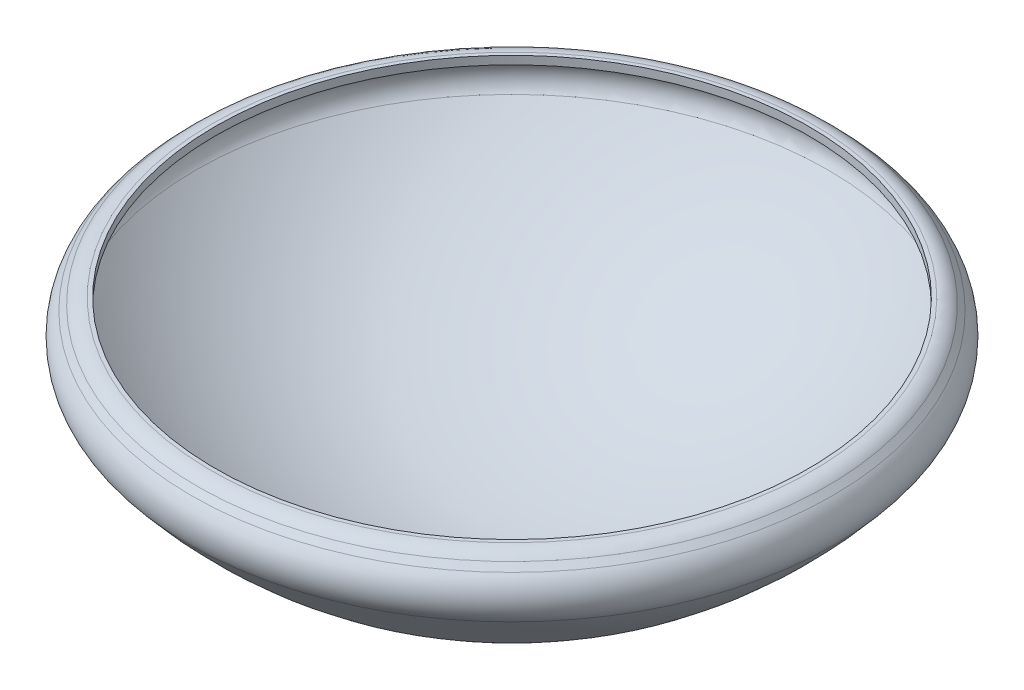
ISO-10303-21;
HEADER;
FILE_DESCRIPTION(('STEP AP214'),'2;1');
FILE_NAME('part.step','',(''),(''),'','','');
FILE_SCHEMA(('AUTOMOTIVE_DESIGN { 1 0 10303 214 1 1 1 1 }'));
ENDSEC;
DATA;
#1=APPLICATION_CONTEXT('core data for automotive mechanical design processes');
#2=APPLICATION_PROTOCOL_DEFINITION('international standard','automotive_design',2000,#1);
#3=PRODUCT_CONTEXT('',#1,'mechanical');
#4=PRODUCT('Part','Part','',(#3));
#5=PRODUCT_RELATED_PRODUCT_CATEGORY('part','',(#4));
#6=PRODUCT_DEFINITION_FORMATION('','',#4);
#7=PRODUCT_DEFINITION_CONTEXT('part definition',#1,'design');
#8=PRODUCT_DEFINITION('design','',#6,#7);
#9=PRODUCT_DEFINITION_SHAPE('','',#8);
#10=(LENGTH_UNIT() NAMED_UNIT(*) SI_UNIT(.MILLI.,.METRE.));
#11=(NAMED_UNIT(*) PLANE_ANGLE_UNIT() SI_UNIT($,.RADIAN.));
#12=(NAMED_UNIT(*) SI_UNIT($,.STERADIAN.) SOLID_ANGLE_UNIT());
#13=UNCERTAINTY_MEASURE_WITH_UNIT(LENGTH_MEASURE(1.E-05),#10,'distance_accuracy_value','');
#14=(GEOMETRIC_REPRESENTATION_CONTEXT(3) GLOBAL_UNCERTAINTY_ASSIGNED_CONTEXT((#13)) GLOBAL_UNIT_ASSIGNED_CONTEXT((#10,
#11,#12)) REPRESENTATION_CONTEXT('',''));
#15=CARTESIAN_POINT('',(0.,0.,0.));
#16=DIRECTION('',(0.,0.,1.));
#17=DIRECTION('',(1.,0.,0.));
#18=AXIS2_PLACEMENT_3D('',#15,#16,#17);
#19=CARTESIAN_POINT('',(7.29289321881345,0.,0.));
#20=DIRECTION('',(0.,-1.,0.));
#21=DIRECTION('',(1.,0.,0.));
#22=AXIS2_PLACEMENT_3D('',#19,#20,#21);
#23=PLANE('',#22);
#24=CARTESIAN_POINT('',(0.,0.,0.));
#25=DIRECTION('',(0.,1.,0.));
#26=DIRECTION('',(-1.,0.,0.));
#27=AXIS2_PLACEMENT_3D('',#24,#25,#26);
#28=CIRCLE('',#27,7.2);
#29=CARTESIAN_POINT('',(-7.2,0.,0.));
#30=VERTEX_POINT('',#29);
#31=EDGE_CURVE('E10',#30,#30,#28,.T.);
#32=ORIENTED_EDGE('',*,*,#31,.F.);
#33=EDGE_LOOP('',(#32));
#34=FACE_BOUND('',#33,.T.);
#35=CARTESIAN_POINT('',(0.,0.,0.));
#36=DIRECTION('',(0.,1.,0.));
#37=DIRECTION('',(-1.,0.,0.));
#38=AXIS2_PLACEMENT_3D('',#35,#36,#37);
#39=CIRCLE('',#38,7.29289321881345);
#40=CARTESIAN_POINT('',(-7.29289321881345,0.,0.));
#41=VERTEX_POINT('',#40);
#42=EDGE_CURVE('E64',#41,#41,#39,.T.);
#43=ORIENTED_EDGE('',*,*,#42,.T.);
#44=EDGE_LOOP('',(#43));
#45=FACE_BOUND('',#44,.T.);
#46=ADVANCED_FACE('F30',(#34,#45),#23,.F.);
#47=CARTESIAN_POINT('',(0.,3.10693936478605,0.));
#48=DIRECTION('',(0.,1.,0.));
#49=DIRECTION('',(-1.,0.,0.));
#50=AXIS2_PLACEMENT_3D('',#47,#48,#49);
#51=CYLINDRICAL_SURFACE('',#50,7.2);
#52=ORIENTED_EDGE('',*,*,#31,.T.);
#53=EDGE_LOOP('',(#52));
#54=FACE_BOUND('',#53,.T.);
#55=CARTESIAN_POINT('',(0.,-0.200000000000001,0.));
#56=DIRECTION('',(0.,1.,0.));
#57=DIRECTION('',(-1.,0.,0.));
#58=AXIS2_PLACEMENT_3D('',#55,#56,#57);
#59=CIRCLE('',#58,7.2);
#60=CARTESIAN_POINT('',(-7.2,-0.200000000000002,0.));
#61=VERTEX_POINT('',#60);
#62=EDGE_CURVE('E36',#61,#61,#59,.T.);
#63=ORIENTED_EDGE('',*,*,#62,.F.);
#64=EDGE_LOOP('',(#63));
#65=FACE_BOUND('',#64,.T.);
#66=ADVANCED_FACE('F98',(#54,#65),#51,.F.);
#67=CARTESIAN_POINT('',(7.29289321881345,-0.2,0.));
#68=DIRECTION('',(0.,-1.,0.));
#69=DIRECTION('',(1.,0.,0.));
#70=AXIS2_PLACEMENT_3D('',#67,#68,#69);
#71=PLANE('',#70);
#72=ORIENTED_EDGE('',*,*,#62,.T.);
#73=EDGE_LOOP('',(#72));
#74=FACE_BOUND('',#73,.T.);
#75=CARTESIAN_POINT('',(0.,-0.200000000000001,0.));
#76=DIRECTION('',(0.,1.,0.));
#77=DIRECTION('',(-1.,0.,0.));
#78=AXIS2_PLACEMENT_3D('',#75,#76,#77);
#79=CIRCLE('',#78,7.29289321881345);
#80=CARTESIAN_POINT('',(-7.29289321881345,-0.200000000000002,0.));
#81=VERTEX_POINT('',#80);
#82=EDGE_CURVE('E40',#81,#81,#79,.T.);
#83=ORIENTED_EDGE('',*,*,#82,.F.);
#84=EDGE_LOOP('',(#83));
#85=FACE_BOUND('',#84,.T.);
#86=ADVANCED_FACE('F103',(#74,#85),#71,.T.);
#87=CARTESIAN_POINT('',(0.,-0.500000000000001,0.));
#88=DIRECTION('',(0.,1.,0.));
#89=DIRECTION('',(-1.,0.,0.));
#90=AXIS2_PLACEMENT_3D('',#87,#88,#89);
#91=TOROIDAL_SURFACE('',#90,7.29289321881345,0.3);
#92=ORIENTED_EDGE('',*,*,#82,.T.);
#93=EDGE_LOOP('',(#92));
#94=FACE_BOUND('',#93,.T.);
#95=CARTESIAN_POINT('',(0.,-0.287867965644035,0.));
#96=DIRECTION('',(0.,1.,0.));
#97=DIRECTION('',(-1.,0.,0.));
#98=AXIS2_PLACEMENT_3D('',#95,#96,#97);
#99=CIRCLE('',#98,7.50502525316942);
#100=CARTESIAN_POINT('',(-7.50502525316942,-0.287867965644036,0.));
#101=VERTEX_POINT('',#100);
#102=EDGE_CURVE('E44',#101,#101,#99,.T.);
#103=ORIENTED_EDGE('',*,*,#102,.F.);
#104=EDGE_LOOP('',(#103));
#105=FACE_BOUND('',#104,.T.);
#106=ADVANCED_FACE('F107',(#94,#105),#91,.F.);
#107=CARTESIAN_POINT('',(0.,-0.421751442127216,0.));
#108=DIRECTION('',(0.,-1.,0.));
#109=DIRECTION('',(1.,0.,0.));
#110=AXIS2_PLACEMENT_3D('',#107,#108,#109);
#111=CONICAL_SURFACE('',#110,7.6389087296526,0.785398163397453);
#112=ORIENTED_EDGE('',*,*,#102,.T.);
#113=EDGE_LOOP('',(#112));
#114=FACE_BOUND('',#113,.T.);
#115=CARTESIAN_POINT('',(0.,-0.421751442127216,0.));
#116=DIRECTION('',(0.,1.,0.));
#117=DIRECTION('',(-1.,0.,0.));
#118=AXIS2_PLACEMENT_3D('',#115,#116,#117);
#119=CIRCLE('',#118,7.6389087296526);
#120=CARTESIAN_POINT('',(-7.6389087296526,-0.421751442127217,0.));
#121=VERTEX_POINT('',#120);
#122=EDGE_CURVE('E49',#121,#121,#119,.T.);
#123=ORIENTED_EDGE('',*,*,#122,.F.);
#124=EDGE_LOOP('',(#123));
#125=FACE_BOUND('',#124,.T.);
#126=ADVANCED_FACE('F113',(#114,#125),#111,.F.);
#127=CARTESIAN_POINT('',(0.,-0.810660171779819,0.));
#128=DIRECTION('',(0.,1.,0.));
#129=DIRECTION('',(-1.,0.,0.));
#130=AXIS2_PLACEMENT_3D('',#127,#128,#129);
#131=TOROIDAL_SURFACE('',#130,7.25,0.550000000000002);
#132=ORIENTED_EDGE('',*,*,#122,.T.);
#133=EDGE_LOOP('',(#132));
#134=FACE_BOUND('',#133,.T.);
#135=CARTESIAN_POINT('',(0.,-1.15858454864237,0.));
#136=DIRECTION('',(0.,1.,0.));
#137=DIRECTION('',(-1.,0.,0.));
#138=AXIS2_PLACEMENT_3D('',#135,#136,#137);
#139=CIRCLE('',#138,7.67596787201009);
#140=CARTESIAN_POINT('',(-7.67596787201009,-1.15858454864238,0.));
#141=VERTEX_POINT('',#140);
#142=EDGE_CURVE('E52',#141,#141,#139,.T.);
#143=ORIENTED_EDGE('',*,*,#142,.F.);
#144=EDGE_LOOP('',(#143));
#145=FACE_BOUND('',#144,.T.);
#146=ADVANCED_FACE('F94',(#134,#145),#131,.F.);
#147=CARTESIAN_POINT('',(0.,5.11103462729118,0.));
#148=DIRECTION('',(0.,1.,0.));
#149=DIRECTION('',(-1.,0.,0.));
#150=AXIS2_PLACEMENT_3D('',#147,#148,#149);
#151=SPHERICAL_SURFACE('',#150,9.91103462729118);
#152=ORIENTED_EDGE('',*,*,#142,.T.);
#153=EDGE_LOOP('',(#152));
#154=FACE_BOUND('',#153,.T.);
#155=ADVANCED_FACE('F89',(#154),#151,.F.);
#156=CARTESIAN_POINT('',(0.,5.11103462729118,0.));
#157=DIRECTION('',(0.,1.,0.));
#158=DIRECTION('',(-1.,0.,0.));
#159=AXIS2_PLACEMENT_3D('',#156,#157,#158);
#160=SPHERICAL_SURFACE('',#159,10.1110346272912);
#161=CARTESIAN_POINT('',(0.,-1.28510250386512,0.));
#162=DIRECTION('',(0.,1.,0.));
#163=DIRECTION('',(-1.,0.,0.));
#164=AXIS2_PLACEMENT_3D('',#161,#162,#163);
#165=CIRCLE('',#164,7.83086528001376);
#166=CARTESIAN_POINT('',(-7.83086528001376,-1.28510250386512,0.));
#167=VERTEX_POINT('',#166);
#168=EDGE_CURVE('E55',#167,#167,#165,.T.);
#169=ORIENTED_EDGE('',*,*,#168,.F.);
#170=EDGE_LOOP('',(#169));
#171=FACE_BOUND('',#170,.T.);
#172=ADVANCED_FACE('F84',(#171),#160,.T.);
#173=CARTESIAN_POINT('',(0.,-0.810660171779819,0.));
#174=DIRECTION('',(0.,1.,0.));
#175=DIRECTION('',(-1.,0.,0.));
#176=AXIS2_PLACEMENT_3D('',#173,#174,#175);
#177=TOROIDAL_SURFACE('',#176,7.25,0.750000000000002);
#178=CARTESIAN_POINT('',(0.,-0.280330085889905,0.));
#179=DIRECTION('',(0.,1.,0.));
#180=DIRECTION('',(-1.,0.,0.));
#181=AXIS2_PLACEMENT_3D('',#178,#179,#180);
#182=CIRCLE('',#181,7.78033008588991);
#183=CARTESIAN_POINT('',(-7.78033008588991,-0.280330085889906,0.));
#184=VERTEX_POINT('',#183);
#185=EDGE_CURVE('E58',#184,#184,#182,.T.);
#186=ORIENTED_EDGE('',*,*,#185,.F.);
#187=EDGE_LOOP('',(#186));
#188=FACE_BOUND('',#187,.T.);
#189=ORIENTED_EDGE('',*,*,#168,.T.);
#190=EDGE_LOOP('',(#189));
#191=FACE_BOUND('',#190,.T.);
#192=ADVANCED_FACE('F78',(#188,#191),#177,.T.);
#193=CARTESIAN_POINT('',(0.,-0.280330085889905,0.));
#194=DIRECTION('',(0.,-1.,0.));
#195=DIRECTION('',(1.,0.,0.));
#196=AXIS2_PLACEMENT_3D('',#193,#194,#195);
#197=CONICAL_SURFACE('',#196,7.78033008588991,0.785398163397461);
#198=CARTESIAN_POINT('',(0.,-0.146446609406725,0.));
#199=DIRECTION('',(0.,1.,0.));
#200=DIRECTION('',(-1.,0.,0.));
#201=AXIS2_PLACEMENT_3D('',#198,#199,#200);
#202=CIRCLE('',#201,7.64644660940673);
#203=CARTESIAN_POINT('',(-7.64644660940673,-0.146446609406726,0.));
#204=VERTEX_POINT('',#203);
#205=EDGE_CURVE('E61',#204,#204,#202,.T.);
#206=ORIENTED_EDGE('',*,*,#205,.F.);
#207=EDGE_LOOP('',(#206));
#208=FACE_BOUND('',#207,.T.);
#209=ORIENTED_EDGE('',*,*,#185,.T.);
#210=EDGE_LOOP('',(#209));
#211=FACE_BOUND('',#210,.T.);
#212=ADVANCED_FACE('F72',(#208,#211),#197,.T.);
#213=CARTESIAN_POINT('',(0.,-0.500000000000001,0.));
#214=DIRECTION('',(0.,1.,0.));
#215=DIRECTION('',(-1.,0.,0.));
#216=AXIS2_PLACEMENT_3D('',#213,#214,#215);
#217=TOROIDAL_SURFACE('',#216,7.29289321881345,0.5);
#218=ORIENTED_EDGE('',*,*,#42,.F.);
#219=EDGE_LOOP('',(#218));
#220=FACE_BOUND('',#219,.T.);
#221=ORIENTED_EDGE('',*,*,#205,.T.);
#222=EDGE_LOOP('',(#221));
#223=FACE_BOUND('',#222,.T.);
#224=ADVANCED_FACE('F69',(#220,#223),#217,.T.);
#225=CLOSED_SHELL('',(#46,#66,#86,#106,#126,#146,#155,#172,#192,#212,#224));
#226=MANIFOLD_SOLID_BREP('B2',#225);
#227=ADVANCED_BREP_SHAPE_REPRESENTATION('',(#18,#226),#14);
#228=SHAPE_DEFINITION_REPRESENTATION(#9,#227);
ENDSEC;
END-ISO-10303-21;
